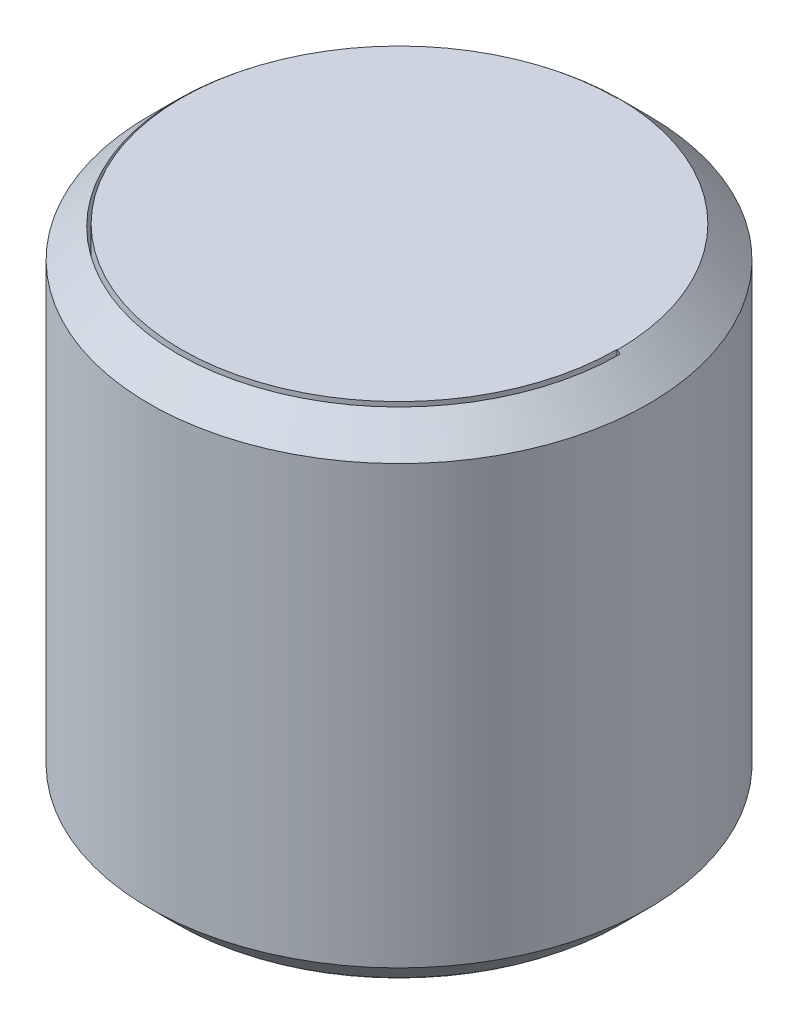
ISO-10303-21;
HEADER;
FILE_DESCRIPTION(('STEP AP214'),'2;1');
FILE_NAME('part.step','',(''),(''),'','','');
FILE_SCHEMA(('AUTOMOTIVE_DESIGN { 1 0 10303 214 1 1 1 1 }'));
ENDSEC;
DATA;
#1=APPLICATION_CONTEXT('core data for automotive mechanical design processes');
#2=APPLICATION_PROTOCOL_DEFINITION('international standard','automotive_design',2000,#1);
#3=PRODUCT_CONTEXT('',#1,'mechanical');
#4=PRODUCT('Part','Part','',(#3));
#5=PRODUCT_RELATED_PRODUCT_CATEGORY('part','',(#4));
#6=PRODUCT_DEFINITION_FORMATION('','',#4);
#7=PRODUCT_DEFINITION_CONTEXT('part definition',#1,'design');
#8=PRODUCT_DEFINITION('design','',#6,#7);
#9=PRODUCT_DEFINITION_SHAPE('','',#8);
#10=(LENGTH_UNIT() NAMED_UNIT(*) SI_UNIT(.MILLI.,.METRE.));
#11=(NAMED_UNIT(*) PLANE_ANGLE_UNIT() SI_UNIT($,.RADIAN.));
#12=(NAMED_UNIT(*) SI_UNIT($,.STERADIAN.) SOLID_ANGLE_UNIT());
#13=UNCERTAINTY_MEASURE_WITH_UNIT(LENGTH_MEASURE(1.E-05),#10,'distance_accuracy_value','');
#14=(GEOMETRIC_REPRESENTATION_CONTEXT(3) GLOBAL_UNCERTAINTY_ASSIGNED_CONTEXT((#13)) GLOBAL_UNIT_ASSIGNED_CONTEXT((#10,
#11,#12)) REPRESENTATION_CONTEXT('',''));
#15=CARTESIAN_POINT('',(0.,0.,0.));
#16=DIRECTION('',(0.,0.,1.));
#17=DIRECTION('',(1.,0.,0.));
#18=AXIS2_PLACEMENT_3D('',#15,#16,#17);
#19=CARTESIAN_POINT('',(-1.66533453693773E-13,7.99999999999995,0.));
#20=DIRECTION('',(0.,0.999999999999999,0.));
#21=DIRECTION('',(0.,0.,1.00000000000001));
#22=AXIS2_PLACEMENT_3D('',#19,#20,#21);
#23=PLANE('',#22);
#24=DIRECTION('',(1.00000000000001,0.,0.));
#25=VECTOR('',#24,1.);
#26=CARTESIAN_POINT('',(1.7574999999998,7.99999999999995,1.66533453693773E-13));
#27=LINE('',#26,#25);
#28=CARTESIAN_POINT('',(3.48999999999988,7.99999999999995,1.94289029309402E-13));
#29=VERTEX_POINT('',#28);
#30=CARTESIAN_POINT('',(3.49999999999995,7.99999999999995,1.94289029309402E-13));
#31=VERTEX_POINT('',#30);
#32=EDGE_CURVE('E140',#29,#31,#27,.T.);
#33=ORIENTED_EDGE('',*,*,#32,.T.);
#34=CARTESIAN_POINT('',(-1.66533453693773E-13,7.99999999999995,0.));
#35=DIRECTION('',(0.,0.999999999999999,0.));
#36=DIRECTION('',(0.,0.,1.00000000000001));
#37=AXIS2_PLACEMENT_3D('',#34,#35,#36);
#38=CIRCLE('',#37,3.49999999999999);
#39=CARTESIAN_POINT('',(-1.66533453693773E-13,7.99999999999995,-3.49999999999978));
#40=VERTEX_POINT('',#39);
#41=EDGE_CURVE('E136',#31,#40,#38,.T.);
#42=ORIENTED_EDGE('',*,*,#41,.T.);
#43=DIRECTION('',(0.,0.,1.00000000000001));
#44=VECTOR('',#43,1.);
#45=CARTESIAN_POINT('',(-1.11022302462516E-13,7.99999999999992,-1.75749999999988));
#46=LINE('',#45,#44);
#47=CARTESIAN_POINT('',(-3.33066907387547E-13,7.99999999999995,-3.48999999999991));
#48=VERTEX_POINT('',#47);
#49=EDGE_CURVE('E131',#40,#48,#46,.T.);
#50=ORIENTED_EDGE('',*,*,#49,.T.);
#51=CARTESIAN_POINT('',(-1.66533453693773E-13,7.99999999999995,0.));
#52=DIRECTION('',(0.,0.999999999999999,0.));
#53=DIRECTION('',(0.,0.,-1.00000000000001));
#54=AXIS2_PLACEMENT_3D('',#51,#52,#53);
#55=CIRCLE('',#54,3.49);
#56=EDGE_CURVE('E134',#48,#29,#55,.T.);
#57=ORIENTED_EDGE('',*,*,#56,.T.);
#58=EDGE_LOOP('',(#33,#42,#50,#57));
#59=FACE_BOUND('',#58,.T.);
#60=ADVANCED_FACE('F38',(#59),#23,.T.);
#61=CARTESIAN_POINT('',(0.,0.,0.));
#62=DIRECTION('',(0.,-0.999999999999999,0.));
#63=DIRECTION('',(0.,0.,-1.00000000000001));
#64=AXIS2_PLACEMENT_3D('',#61,#62,#63);
#65=PLANE('',#64);
#66=DIRECTION('',(0.,0.,-1.00000000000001));
#67=VECTOR('',#66,1.);
#68=CARTESIAN_POINT('',(-2.22044604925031E-13,0.,-1.75749999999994));
#69=LINE('',#68,#67);
#70=CARTESIAN_POINT('',(0.,0.,-3.48999999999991));
#71=VERTEX_POINT('',#70);
#72=CARTESIAN_POINT('',(-1.11022302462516E-13,0.,-3.49999999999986));
#73=VERTEX_POINT('',#72);
#74=EDGE_CURVE('E156',#71,#73,#69,.T.);
#75=ORIENTED_EDGE('',*,*,#74,.T.);
#76=CARTESIAN_POINT('',(0.,0.,0.));
#77=DIRECTION('',(0.,-0.999999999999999,0.));
#78=DIRECTION('',(0.,0.,-1.00000000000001));
#79=AXIS2_PLACEMENT_3D('',#76,#77,#78);
#80=CIRCLE('',#79,3.49999999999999);
#81=CARTESIAN_POINT('',(3.49999999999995,0.,0.));
#82=VERTEX_POINT('',#81);
#83=EDGE_CURVE('E11',#73,#82,#80,.T.);
#84=ORIENTED_EDGE('',*,*,#83,.T.);
#85=DIRECTION('',(-1.00000000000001,0.,0.));
#86=VECTOR('',#85,1.);
#87=CARTESIAN_POINT('',(1.75749999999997,0.,2.4980018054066E-13));
#88=LINE('',#87,#86);
#89=CARTESIAN_POINT('',(3.48999999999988,0.,1.94289029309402E-13));
#90=VERTEX_POINT('',#89);
#91=EDGE_CURVE('E184',#82,#90,#88,.T.);
#92=ORIENTED_EDGE('',*,*,#91,.T.);
#93=CARTESIAN_POINT('',(0.,0.,0.));
#94=DIRECTION('',(0.,-0.999999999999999,0.));
#95=DIRECTION('',(0.,0.,-1.00000000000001));
#96=AXIS2_PLACEMENT_3D('',#93,#94,#95);
#97=CIRCLE('',#96,3.49);
#98=EDGE_CURVE('E141',#90,#71,#97,.T.);
#99=ORIENTED_EDGE('',*,*,#98,.T.);
#100=EDGE_LOOP('',(#75,#84,#92,#99));
#101=FACE_BOUND('',#100,.T.);
#102=DIRECTION('',(0.500000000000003,0.,0.866025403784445));
#103=VECTOR('',#102,1.);
#104=CARTESIAN_POINT('',(-1.44337567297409,0.,1.50000000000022));
#105=LINE('',#104,#103);
#106=CARTESIAN_POINT('',(-2.30940107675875,0.,0.));
#107=VERTEX_POINT('',#106);
#108=CARTESIAN_POINT('',(-1.15470053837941,0.,2.00000000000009));
#109=VERTEX_POINT('',#108);
#110=EDGE_CURVE('E169',#107,#109,#105,.T.);
#111=ORIENTED_EDGE('',*,*,#110,.T.);
#112=DIRECTION('',(1.00000000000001,0.,0.));
#113=VECTOR('',#112,1.);
#114=CARTESIAN_POINT('',(0.577350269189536,0.,2.00000000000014));
#115=LINE('',#114,#113);
#116=CARTESIAN_POINT('',(1.15470053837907,0.,2.0000000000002));
#117=VERTEX_POINT('',#116);
#118=EDGE_CURVE('E203',#109,#117,#115,.T.);
#119=ORIENTED_EDGE('',*,*,#118,.T.);
#120=DIRECTION('',(0.500000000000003,0.,-0.866025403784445));
#121=VECTOR('',#120,1.);
#122=CARTESIAN_POINT('',(2.02072594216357,0.,0.500000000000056));
#123=LINE('',#122,#121);
#124=CARTESIAN_POINT('',(2.30940107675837,0.,0.));
#125=VERTEX_POINT('',#124);
#126=EDGE_CURVE('E175',#117,#125,#123,.T.);
#127=ORIENTED_EDGE('',*,*,#126,.T.);
#128=DIRECTION('',(-0.500000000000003,0.,-0.866025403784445));
#129=VECTOR('',#128,1.);
#130=CARTESIAN_POINT('',(1.44337567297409,0.,-1.49999999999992));
#131=LINE('',#130,#129);
#132=CARTESIAN_POINT('',(1.15470053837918,0.,-1.99999999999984));
#133=VERTEX_POINT('',#132);
#134=EDGE_CURVE('E171',#125,#133,#131,.T.);
#135=ORIENTED_EDGE('',*,*,#134,.T.);
#136=DIRECTION('',(-1.00000000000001,0.,0.));
#137=VECTOR('',#136,1.);
#138=CARTESIAN_POINT('',(-0.577350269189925,0.,-1.99999999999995));
#139=LINE('',#138,#137);
#140=CARTESIAN_POINT('',(-1.15470053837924,0.,-1.99999999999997));
#141=VERTEX_POINT('',#140);
#142=EDGE_CURVE('E176',#133,#141,#139,.T.);
#143=ORIENTED_EDGE('',*,*,#142,.T.);
#144=DIRECTION('',(-0.500000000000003,0.,0.866025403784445));
#145=VECTOR('',#144,1.);
#146=CARTESIAN_POINT('',(-2.0207259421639,0.,-0.499999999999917));
#147=LINE('',#146,#145);
#148=EDGE_CURVE('E197',#141,#107,#147,.T.);
#149=ORIENTED_EDGE('',*,*,#148,.T.);
#150=EDGE_LOOP('',(#111,#119,#127,#135,#143,#149));
#151=FACE_BOUND('',#150,.T.);
#152=ADVANCED_FACE('F262',(#101,#151),#65,.T.);
#153=CARTESIAN_POINT('',(0.,4.,0.));
#154=DIRECTION('',(0.,-0.999999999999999,0.));
#155=DIRECTION('',(0.,0.,-1.00000000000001));
#156=AXIS2_PLACEMENT_3D('',#153,#154,#155);
#157=CYLINDRICAL_SURFACE('',#156,4.);
#158=CARTESIAN_POINT('',(-1.66533453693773E-13,7.49999999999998,0.));
#159=DIRECTION('',(0.,0.999999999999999,0.));
#160=DIRECTION('',(0.,0.,1.00000000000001));
#161=AXIS2_PLACEMENT_3D('',#158,#159,#160);
#162=CIRCLE('',#161,4.);
#163=CARTESIAN_POINT('',(0.,7.49999999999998,-4.00000000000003));
#164=VERTEX_POINT('',#163);
#165=EDGE_CURVE('E47',#164,#164,#162,.F.);
#166=CARTESIAN_POINT('',(0.,0.5,0.));
#167=DIRECTION('',(0.,-0.999999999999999,0.));
#168=DIRECTION('',(0.,0.,-1.00000000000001));
#169=AXIS2_PLACEMENT_3D('',#166,#167,#168);
#170=CIRCLE('',#169,4.);
#171=CARTESIAN_POINT('',(0.,0.500000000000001,-4.00000000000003));
#172=VERTEX_POINT('',#171);
#173=EDGE_CURVE('E243',#172,#172,#170,.F.);
#174=CARTESIAN_POINT('',(0.,7.49999999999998,-4.00000000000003));
#175=CARTESIAN_POINT('',(0.,7.42708333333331,-4.00000000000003));
#176=CARTESIAN_POINT('',(0.,7.35416666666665,-4.00000000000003));
#177=CARTESIAN_POINT('',(0.,7.20833333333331,-4.00000000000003));
#178=CARTESIAN_POINT('',(0.,7.13541666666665,-4.00000000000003));
#179=CARTESIAN_POINT('',(0.,6.98958333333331,-4.00000000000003));
#180=CARTESIAN_POINT('',(0.,6.91666666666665,-4.00000000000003));
#181=CARTESIAN_POINT('',(0.,6.77083333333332,-4.00000000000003));
#182=CARTESIAN_POINT('',(0.,6.69791666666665,-4.00000000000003));
#183=CARTESIAN_POINT('',(0.,6.55208333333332,-4.00000000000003));
#184=CARTESIAN_POINT('',(0.,6.47916666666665,-4.00000000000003));
#185=CARTESIAN_POINT('',(0.,6.33333333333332,-4.00000000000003));
#186=CARTESIAN_POINT('',(0.,6.26041666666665,-4.00000000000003));
#187=CARTESIAN_POINT('',(0.,6.11458333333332,-4.00000000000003));
#188=CARTESIAN_POINT('',(0.,6.04166666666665,-4.00000000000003));
#189=CARTESIAN_POINT('',(0.,5.89583333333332,-4.00000000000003));
#190=CARTESIAN_POINT('',(0.,5.82291666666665,-4.00000000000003));
#191=CARTESIAN_POINT('',(0.,5.67708333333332,-4.00000000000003));
#192=CARTESIAN_POINT('',(0.,5.60416666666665,-4.00000000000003));
#193=CARTESIAN_POINT('',(0.,5.45833333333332,-4.00000000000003));
#194=CARTESIAN_POINT('',(0.,5.38541666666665,-4.00000000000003));
#195=CARTESIAN_POINT('',(0.,5.23958333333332,-4.00000000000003));
#196=CARTESIAN_POINT('',(0.,5.16666666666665,-4.00000000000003));
#197=CARTESIAN_POINT('',(0.,5.02083333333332,-4.00000000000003));
#198=CARTESIAN_POINT('',(0.,4.94791666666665,-4.00000000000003));
#199=CARTESIAN_POINT('',(0.,4.80208333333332,-4.00000000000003));
#200=CARTESIAN_POINT('',(0.,4.72916666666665,-4.00000000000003));
#201=CARTESIAN_POINT('',(0.,4.58333333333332,-4.00000000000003));
#202=CARTESIAN_POINT('',(0.,4.51041666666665,-4.00000000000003));
#203=CARTESIAN_POINT('',(0.,4.36458333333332,-4.00000000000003));
#204=CARTESIAN_POINT('',(0.,4.29166666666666,-4.00000000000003));
#205=CARTESIAN_POINT('',(0.,4.14583333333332,-4.00000000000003));
#206=CARTESIAN_POINT('',(0.,4.07291666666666,-4.00000000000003));
#207=CARTESIAN_POINT('',(0.,3.92708333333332,-4.00000000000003));
#208=CARTESIAN_POINT('',(0.,3.85416666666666,-4.00000000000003));
#209=CARTESIAN_POINT('',(0.,3.70833333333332,-4.00000000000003));
#210=CARTESIAN_POINT('',(0.,3.63541666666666,-4.00000000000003));
#211=CARTESIAN_POINT('',(0.,3.48958333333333,-4.00000000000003));
#212=CARTESIAN_POINT('',(0.,3.41666666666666,-4.00000000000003));
#213=CARTESIAN_POINT('',(0.,3.27083333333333,-4.00000000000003));
#214=CARTESIAN_POINT('',(0.,3.19791666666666,-4.00000000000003));
#215=CARTESIAN_POINT('',(0.,3.05208333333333,-4.00000000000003));
#216=CARTESIAN_POINT('',(0.,2.97916666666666,-4.00000000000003));
#217=CARTESIAN_POINT('',(0.,2.83333333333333,-4.00000000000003));
#218=CARTESIAN_POINT('',(0.,2.76041666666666,-4.00000000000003));
#219=CARTESIAN_POINT('',(0.,2.61458333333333,-4.00000000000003));
#220=CARTESIAN_POINT('',(0.,2.54166666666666,-4.00000000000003));
#221=CARTESIAN_POINT('',(0.,2.39583333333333,-4.00000000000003));
#222=CARTESIAN_POINT('',(0.,2.32291666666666,-4.00000000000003));
#223=CARTESIAN_POINT('',(0.,2.17708333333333,-4.00000000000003));
#224=CARTESIAN_POINT('',(0.,2.10416666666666,-4.00000000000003));
#225=CARTESIAN_POINT('',(0.,1.95833333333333,-4.00000000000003));
#226=CARTESIAN_POINT('',(0.,1.88541666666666,-4.00000000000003));
#227=CARTESIAN_POINT('',(0.,1.73958333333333,-4.00000000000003));
#228=CARTESIAN_POINT('',(0.,1.66666666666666,-4.00000000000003));
#229=CARTESIAN_POINT('',(0.,1.52083333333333,-4.00000000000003));
#230=CARTESIAN_POINT('',(0.,1.44791666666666,-4.00000000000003));
#231=CARTESIAN_POINT('',(0.,1.30208333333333,-4.00000000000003));
#232=CARTESIAN_POINT('',(0.,1.22916666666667,-4.00000000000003));
#233=CARTESIAN_POINT('',(0.,1.08333333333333,-4.00000000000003));
#234=CARTESIAN_POINT('',(0.,1.01041666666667,-4.00000000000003));
#235=CARTESIAN_POINT('',(0.,0.864583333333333,-4.00000000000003));
#236=CARTESIAN_POINT('',(0.,0.791666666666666,-4.00000000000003));
#237=CARTESIAN_POINT('',(0.,0.645833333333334,-4.00000000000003));
#238=CARTESIAN_POINT('',(0.,0.572916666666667,-4.00000000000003));
#239=CARTESIAN_POINT('',(0.,0.500000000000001,-4.00000000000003));
#240=B_SPLINE_CURVE_WITH_KNOTS('',3,(#174,#175,#176,#177,#178,#179,#180,#181,#182,#183,#184,
#185,#186,#187,#188,#189,#190,#191,#192,#193,#194,#195,#196,#197,#198,#199,#200,#201,#202,#203,
#204,#205,#206,#207,#208,#209,#210,#211,#212,#213,#214,#215,#216,#217,#218,#219,#220,#221,#222,
#223,#224,#225,#226,#227,#228,#229,#230,#231,#232,#233,#234,#235,#236,#237,#238,#239),
.UNSPECIFIED.,.F.,.F.,(4,2,2,2,2,2,2,2,2,2,2,2,2,2,2,2,2,2,2,2,2,2,2,2,2,2,2,2,2,2,2,2,4),(0.,
0.218749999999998,0.437499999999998,0.656249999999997,0.874999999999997,1.09375,1.3125,
1.53124999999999,1.74999999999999,1.96874999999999,2.18749999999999,2.40624999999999,
2.62499999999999,2.84374999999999,3.06249999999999,3.28124999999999,3.49999999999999,
3.71874999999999,3.93749999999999,4.15624999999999,4.37499999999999,4.59374999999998,
4.81249999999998,5.03124999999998,5.24999999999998,5.46874999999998,5.68749999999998,
5.90624999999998,6.12499999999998,6.34374999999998,6.56249999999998,6.78124999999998,
6.99999999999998),.UNSPECIFIED.);
#241=EDGE_CURVE('BSEAM250',#164,#172,#240,.T.);
#242=ORIENTED_EDGE('',*,*,#165,.T.);
#243=ORIENTED_EDGE('',*,*,#173,.T.);
#244=ORIENTED_EDGE('',*,*,#241,.T.);
#245=ORIENTED_EDGE('',*,*,#241,.F.);
#246=EDGE_LOOP('',(#242,#244,#243,#245));
#247=FACE_BOUND('',#246,.T.);
#248=ADVANCED_FACE('F250',(#247),#157,.T.);
#249=CARTESIAN_POINT('',(3.51499999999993,4.00000000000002,1.11022302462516E-13));
#250=DIRECTION('',(0.,0.,1.00000000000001));
#251=DIRECTION('',(1.00000000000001,0.,0.));
#252=AXIS2_PLACEMENT_3D('',#249,#250,#251);
#253=PLANE('',#252);
#254=DIRECTION('',(0.,0.999999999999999,0.));
#255=VECTOR('',#254,1.);
#256=CARTESIAN_POINT('',(3.53999999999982,7.99999999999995,1.11022302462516E-13));
#257=LINE('',#256,#255);
#258=CARTESIAN_POINT('',(3.53999999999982,0.0400000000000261,1.11022302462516E-13));
#259=VERTEX_POINT('',#258);
#260=CARTESIAN_POINT('',(3.53999999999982,7.95999999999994,1.11022302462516E-13));
#261=VERTEX_POINT('',#260);
#262=EDGE_CURVE('E162',#259,#261,#257,.T.);
#263=ORIENTED_EDGE('',*,*,#262,.T.);
#264=DIRECTION('',(-0.707106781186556,0.707106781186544,0.));
#265=VECTOR('',#264,1.);
#266=CARTESIAN_POINT('',(-1.66533453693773E-13,11.4999999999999,0.));
#267=LINE('',#266,#265);
#268=EDGE_CURVE('E240',#261,#31,#267,.T.);
#269=ORIENTED_EDGE('',*,*,#268,.T.);
#270=ORIENTED_EDGE('',*,*,#32,.F.);
#271=DIRECTION('',(0.,-0.999999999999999,0.));
#272=VECTOR('',#271,1.);
#273=CARTESIAN_POINT('',(3.48999999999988,0.,1.94289029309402E-13));
#274=LINE('',#273,#272);
#275=EDGE_CURVE('E149',#29,#90,#274,.T.);
#276=ORIENTED_EDGE('',*,*,#275,.T.);
#277=ORIENTED_EDGE('',*,*,#91,.F.);
#278=DIRECTION('',(0.707106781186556,0.707106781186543,0.));
#279=VECTOR('',#278,1.);
#280=CARTESIAN_POINT('',(-2.22044604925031E-13,-3.49999999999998,0.));
#281=LINE('',#280,#279);
#282=EDGE_CURVE('E54',#82,#259,#281,.T.);
#283=ORIENTED_EDGE('',*,*,#282,.T.);
#284=EDGE_LOOP('',(#263,#269,#270,#276,#277,#283));
#285=FACE_BOUND('',#284,.T.);
#286=ADVANCED_FACE('F327',(#285),#253,.T.);
#287=CARTESIAN_POINT('',(0.,3.99999999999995,-3.51499999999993));
#288=DIRECTION('',(-1.00000000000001,0.,0.));
#289=DIRECTION('',(0.,0.,1.00000000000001));
#290=AXIS2_PLACEMENT_3D('',#287,#288,#289);
#291=PLANE('',#290);
#292=ORIENTED_EDGE('',*,*,#49,.F.);
#293=DIRECTION('',(0.,-0.707106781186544,-0.707106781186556));
#294=VECTOR('',#293,1.);
#295=CARTESIAN_POINT('',(-1.66533453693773E-13,11.4999999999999,0.));
#296=LINE('',#295,#294);
#297=CARTESIAN_POINT('',(0.,7.95999999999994,-3.5399999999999));
#298=VERTEX_POINT('',#297);
#299=EDGE_CURVE('E230',#40,#298,#296,.T.);
#300=ORIENTED_EDGE('',*,*,#299,.T.);
#301=DIRECTION('',(0.,-0.999999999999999,0.));
#302=VECTOR('',#301,1.);
#303=CARTESIAN_POINT('',(0.,7.99999999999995,-3.5399999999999));
#304=LINE('',#303,#302);
#305=CARTESIAN_POINT('',(-1.66533453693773E-13,0.0399999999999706,-3.53999999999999));
#306=VERTEX_POINT('',#305);
#307=EDGE_CURVE('E158',#298,#306,#304,.T.);
#308=ORIENTED_EDGE('',*,*,#307,.T.);
#309=DIRECTION('',(0.,-0.707106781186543,0.707106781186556));
#310=VECTOR('',#309,1.);
#311=CARTESIAN_POINT('',(-2.22044604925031E-13,-3.49999999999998,0.));
#312=LINE('',#311,#310);
#313=EDGE_CURVE('E227',#306,#73,#312,.T.);
#314=ORIENTED_EDGE('',*,*,#313,.T.);
#315=ORIENTED_EDGE('',*,*,#74,.F.);
#316=DIRECTION('',(0.,0.999999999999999,0.));
#317=VECTOR('',#316,1.);
#318=CARTESIAN_POINT('',(0.,0.,-3.48999999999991));
#319=LINE('',#318,#317);
#320=EDGE_CURVE('E146',#71,#48,#319,.T.);
#321=ORIENTED_EDGE('',*,*,#320,.T.);
#322=EDGE_LOOP('',(#292,#300,#308,#314,#315,#321));
#323=FACE_BOUND('',#322,.T.);
#324=ADVANCED_FACE('F154',(#323),#291,.T.);
#325=CARTESIAN_POINT('',(0.,4.,0.));
#326=DIRECTION('',(0.,-0.999999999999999,0.));
#327=DIRECTION('',(0.,0.,-1.00000000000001));
#328=AXIS2_PLACEMENT_3D('',#325,#326,#327);
#329=CYLINDRICAL_SURFACE('',#328,3.49);
#330=ORIENTED_EDGE('',*,*,#98,.F.);
#331=ORIENTED_EDGE('',*,*,#275,.F.);
#332=ORIENTED_EDGE('',*,*,#56,.F.);
#333=ORIENTED_EDGE('',*,*,#320,.F.);
#334=EDGE_LOOP('',(#330,#331,#332,#333));
#335=FACE_BOUND('',#334,.T.);
#336=ADVANCED_FACE('F145',(#335),#329,.T.);
#337=CARTESIAN_POINT('',(0.,4.,0.));
#338=DIRECTION('',(0.,-0.999999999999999,0.));
#339=DIRECTION('',(0.,0.,-1.00000000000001));
#340=AXIS2_PLACEMENT_3D('',#337,#338,#339);
#341=CYLINDRICAL_SURFACE('',#340,3.54);
#342=ORIENTED_EDGE('',*,*,#307,.F.);
#343=CARTESIAN_POINT('',(-1.66533453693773E-13,7.95999999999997,0.));
#344=DIRECTION('',(0.,-0.999999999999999,0.));
#345=DIRECTION('',(0.,0.,-1.00000000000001));
#346=AXIS2_PLACEMENT_3D('',#343,#344,#345);
#347=CIRCLE('',#346,3.54);
#348=EDGE_CURVE('E61',#298,#261,#347,.F.);
#349=ORIENTED_EDGE('',*,*,#348,.T.);
#350=ORIENTED_EDGE('',*,*,#262,.F.);
#351=CARTESIAN_POINT('',(0.,0.0400000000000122,0.));
#352=DIRECTION('',(0.,0.999999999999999,0.));
#353=DIRECTION('',(0.,0.,1.00000000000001));
#354=AXIS2_PLACEMENT_3D('',#351,#352,#353);
#355=CIRCLE('',#354,3.54);
#356=EDGE_CURVE('E233',#259,#306,#355,.F.);
#357=ORIENTED_EDGE('',*,*,#356,.T.);
#358=EDGE_LOOP('',(#342,#349,#350,#357));
#359=FACE_BOUND('',#358,.T.);
#360=ADVANCED_FACE('F40',(#359),#341,.F.);
#361=CARTESIAN_POINT('',(0.,5.,0.));
#362=DIRECTION('',(0.,-0.999999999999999,0.));
#363=DIRECTION('',(0.,0.,-1.00000000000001));
#364=AXIS2_PLACEMENT_3D('',#361,#362,#363);
#365=PLANE('',#364);
#366=DIRECTION('',(-0.500000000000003,0.,-0.866025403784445));
#367=VECTOR('',#366,1.);
#368=CARTESIAN_POINT('',(-1.15470053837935,5.,2.00000000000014));
#369=LINE('',#368,#367);
#370=CARTESIAN_POINT('',(-1.15470053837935,5.,2.00000000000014));
#371=VERTEX_POINT('',#370);
#372=CARTESIAN_POINT('',(-2.30940107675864,5.,0.));
#373=VERTEX_POINT('',#372);
#374=EDGE_CURVE('E165',#371,#373,#369,.T.);
#375=ORIENTED_EDGE('',*,*,#374,.T.);
#376=DIRECTION('',(0.500000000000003,0.,-0.866025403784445));
#377=VECTOR('',#376,1.);
#378=CARTESIAN_POINT('',(-2.30940107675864,5.,0.));
#379=LINE('',#378,#377);
#380=CARTESIAN_POINT('',(-1.15470053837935,5.,-1.99999999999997));
#381=VERTEX_POINT('',#380);
#382=EDGE_CURVE('E177',#373,#381,#379,.T.);
#383=ORIENTED_EDGE('',*,*,#382,.T.);
#384=DIRECTION('',(1.00000000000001,0.,0.));
#385=VECTOR('',#384,1.);
#386=CARTESIAN_POINT('',(-1.15470053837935,5.,-1.99999999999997));
#387=LINE('',#386,#385);
#388=CARTESIAN_POINT('',(1.15470053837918,4.99999999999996,-1.99999999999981));
#389=VERTEX_POINT('',#388);
#390=EDGE_CURVE('E181',#381,#389,#387,.T.);
#391=ORIENTED_EDGE('',*,*,#390,.T.);
#392=DIRECTION('',(0.500000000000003,0.,0.866025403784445));
#393=VECTOR('',#392,1.);
#394=CARTESIAN_POINT('',(1.15470053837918,4.99999999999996,-1.99999999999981));
#395=LINE('',#394,#393);
#396=CARTESIAN_POINT('',(2.30940107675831,5.00000000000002,1.38777878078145E-13));
#397=VERTEX_POINT('',#396);
#398=EDGE_CURVE('E189',#389,#397,#395,.T.);
#399=ORIENTED_EDGE('',*,*,#398,.T.);
#400=DIRECTION('',(-0.500000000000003,0.,0.866025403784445));
#401=VECTOR('',#400,1.);
#402=CARTESIAN_POINT('',(2.30940107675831,5.00000000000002,1.38777878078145E-13));
#403=LINE('',#402,#401);
#404=CARTESIAN_POINT('',(1.15470053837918,5.,2.00000000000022));
#405=VERTEX_POINT('',#404);
#406=EDGE_CURVE('E185',#397,#405,#403,.T.);
#407=ORIENTED_EDGE('',*,*,#406,.T.);
#408=DIRECTION('',(-1.00000000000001,0.,0.));
#409=VECTOR('',#408,1.);
#410=CARTESIAN_POINT('',(1.15470053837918,5.,2.00000000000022));
#411=LINE('',#410,#409);
#412=EDGE_CURVE('E190',#405,#371,#411,.T.);
#413=ORIENTED_EDGE('',*,*,#412,.T.);
#414=EDGE_LOOP('',(#375,#383,#391,#399,#407,#413));
#415=FACE_BOUND('',#414,.T.);
#416=ADVANCED_FACE('F287',(#415),#365,.T.);
#417=CARTESIAN_POINT('',(1.15470053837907,0.,2.0000000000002));
#418=DIRECTION('',(0.,0.,-1.00000000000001));
#419=DIRECTION('',(-1.00000000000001,0.,0.));
#420=AXIS2_PLACEMENT_3D('',#417,#418,#419);
#421=PLANE('',#420);
#422=ORIENTED_EDGE('',*,*,#412,.F.);
#423=DIRECTION('',(0.,0.999999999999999,0.));
#424=VECTOR('',#423,1.);
#425=CARTESIAN_POINT('',(1.15470053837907,0.,2.0000000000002));
#426=LINE('',#425,#424);
#427=EDGE_CURVE('E195',#117,#405,#426,.T.);
#428=ORIENTED_EDGE('',*,*,#427,.F.);
#429=ORIENTED_EDGE('',*,*,#118,.F.);
#430=DIRECTION('',(0.,0.999999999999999,0.));
#431=VECTOR('',#430,1.);
#432=CARTESIAN_POINT('',(-1.15470053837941,0.,2.00000000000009));
#433=LINE('',#432,#431);
#434=EDGE_CURVE('E206',#109,#371,#433,.T.);
#435=ORIENTED_EDGE('',*,*,#434,.T.);
#436=EDGE_LOOP('',(#422,#428,#429,#435));
#437=FACE_BOUND('',#436,.T.);
#438=ADVANCED_FACE('F291',(#437),#421,.T.);
#439=CARTESIAN_POINT('',(2.30940107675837,0.,0.));
#440=DIRECTION('',(-0.866025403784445,0.,-0.500000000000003));
#441=DIRECTION('',(-0.500000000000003,0.,0.866025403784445));
#442=AXIS2_PLACEMENT_3D('',#439,#440,#441);
#443=PLANE('',#442);
#444=ORIENTED_EDGE('',*,*,#406,.F.);
#445=DIRECTION('',(0.,0.999999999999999,0.));
#446=VECTOR('',#445,1.);
#447=CARTESIAN_POINT('',(2.30940107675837,0.,0.));
#448=LINE('',#447,#446);
#449=EDGE_CURVE('E191',#125,#397,#448,.T.);
#450=ORIENTED_EDGE('',*,*,#449,.F.);
#451=ORIENTED_EDGE('',*,*,#126,.F.);
#452=ORIENTED_EDGE('',*,*,#427,.T.);
#453=EDGE_LOOP('',(#444,#450,#451,#452));
#454=FACE_BOUND('',#453,.T.);
#455=ADVANCED_FACE('F304',(#454),#443,.T.);
#456=CARTESIAN_POINT('',(1.15470053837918,0.,-1.99999999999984));
#457=DIRECTION('',(-0.866025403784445,0.,0.500000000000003));
#458=DIRECTION('',(0.500000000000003,0.,0.866025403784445));
#459=AXIS2_PLACEMENT_3D('',#456,#457,#458);
#460=PLANE('',#459);
#461=ORIENTED_EDGE('',*,*,#398,.F.);
#462=DIRECTION('',(0.,0.999999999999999,0.));
#463=VECTOR('',#462,1.);
#464=CARTESIAN_POINT('',(1.15470053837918,0.,-1.99999999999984));
#465=LINE('',#464,#463);
#466=EDGE_CURVE('E196',#133,#389,#465,.T.);
#467=ORIENTED_EDGE('',*,*,#466,.F.);
#468=ORIENTED_EDGE('',*,*,#134,.F.);
#469=ORIENTED_EDGE('',*,*,#449,.T.);
#470=EDGE_LOOP('',(#461,#467,#468,#469));
#471=FACE_BOUND('',#470,.T.);
#472=ADVANCED_FACE('F302',(#471),#460,.T.);
#473=CARTESIAN_POINT('',(-1.15470053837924,0.,-1.99999999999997));
#474=DIRECTION('',(0.,0.,1.00000000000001));
#475=DIRECTION('',(1.00000000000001,0.,0.));
#476=AXIS2_PLACEMENT_3D('',#473,#474,#475);
#477=PLANE('',#476);
#478=ORIENTED_EDGE('',*,*,#390,.F.);
#479=DIRECTION('',(0.,0.999999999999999,0.));
#480=VECTOR('',#479,1.);
#481=CARTESIAN_POINT('',(-1.15470053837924,0.,-1.99999999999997));
#482=LINE('',#481,#480);
#483=EDGE_CURVE('E211',#141,#381,#482,.T.);
#484=ORIENTED_EDGE('',*,*,#483,.F.);
#485=ORIENTED_EDGE('',*,*,#142,.F.);
#486=ORIENTED_EDGE('',*,*,#466,.T.);
#487=EDGE_LOOP('',(#478,#484,#485,#486));
#488=FACE_BOUND('',#487,.T.);
#489=ADVANCED_FACE('F308',(#488),#477,.T.);
#490=CARTESIAN_POINT('',(-2.30940107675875,0.,0.));
#491=DIRECTION('',(0.866025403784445,0.,0.500000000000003));
#492=DIRECTION('',(0.500000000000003,0.,-0.866025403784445));
#493=AXIS2_PLACEMENT_3D('',#490,#491,#492);
#494=PLANE('',#493);
#495=ORIENTED_EDGE('',*,*,#382,.F.);
#496=DIRECTION('',(0.,0.999999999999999,0.));
#497=VECTOR('',#496,1.);
#498=CARTESIAN_POINT('',(-2.30940107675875,0.,0.));
#499=LINE('',#498,#497);
#500=EDGE_CURVE('E215',#107,#373,#499,.T.);
#501=ORIENTED_EDGE('',*,*,#500,.F.);
#502=ORIENTED_EDGE('',*,*,#148,.F.);
#503=ORIENTED_EDGE('',*,*,#483,.T.);
#504=EDGE_LOOP('',(#495,#501,#502,#503));
#505=FACE_BOUND('',#504,.T.);
#506=ADVANCED_FACE('F284',(#505),#494,.T.);
#507=CARTESIAN_POINT('',(-1.15470053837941,0.,2.00000000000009));
#508=DIRECTION('',(0.866025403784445,0.,-0.500000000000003));
#509=DIRECTION('',(-0.500000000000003,0.,-0.866025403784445));
#510=AXIS2_PLACEMENT_3D('',#507,#508,#509);
#511=PLANE('',#510);
#512=ORIENTED_EDGE('',*,*,#374,.F.);
#513=ORIENTED_EDGE('',*,*,#434,.F.);
#514=ORIENTED_EDGE('',*,*,#110,.F.);
#515=ORIENTED_EDGE('',*,*,#500,.T.);
#516=EDGE_LOOP('',(#512,#513,#514,#515));
#517=FACE_BOUND('',#516,.T.);
#518=ADVANCED_FACE('F257',(#517),#511,.T.);
#519=CARTESIAN_POINT('',(-1.66533453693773E-13,7.99999999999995,0.));
#520=DIRECTION('',(0.,-0.999999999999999,0.));
#521=DIRECTION('',(0.,0.,-1.00000000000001));
#522=AXIS2_PLACEMENT_3D('',#519,#520,#521);
#523=CONICAL_SURFACE('',#522,3.49999999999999,0.785398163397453);
#524=ORIENTED_EDGE('',*,*,#165,.F.);
#525=EDGE_LOOP('',(#524));
#526=FACE_BOUND('',#525,.T.);
#527=ORIENTED_EDGE('',*,*,#299,.F.);
#528=ORIENTED_EDGE('',*,*,#41,.F.);
#529=ORIENTED_EDGE('',*,*,#268,.F.);
#530=ORIENTED_EDGE('',*,*,#348,.F.);
#531=EDGE_LOOP('',(#527,#528,#529,#530));
#532=FACE_BOUND('',#531,.T.);
#533=ADVANCED_FACE('F253',(#526,#532),#523,.T.);
#534=CARTESIAN_POINT('',(0.,0.,0.));
#535=DIRECTION('',(0.,0.999999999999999,0.));
#536=DIRECTION('',(0.,0.,1.00000000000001));
#537=AXIS2_PLACEMENT_3D('',#534,#535,#536);
#538=CONICAL_SURFACE('',#537,3.49999999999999,0.785398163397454);
#539=ORIENTED_EDGE('',*,*,#173,.F.);
#540=EDGE_LOOP('',(#539));
#541=FACE_BOUND('',#540,.T.);
#542=ORIENTED_EDGE('',*,*,#282,.F.);
#543=ORIENTED_EDGE('',*,*,#83,.F.);
#544=ORIENTED_EDGE('',*,*,#313,.F.);
#545=ORIENTED_EDGE('',*,*,#356,.F.);
#546=EDGE_LOOP('',(#542,#543,#544,#545));
#547=FACE_BOUND('',#546,.T.);
#548=ADVANCED_FACE('F256',(#541,#547),#538,.T.);
#549=CLOSED_SHELL('',(#60,#152,#248,#286,#324,#336,#360,#416,#438,#455,#472,#489,#506,#518,#533,#548));
#550=MANIFOLD_SOLID_BREP('B2',#549);
#551=ADVANCED_BREP_SHAPE_REPRESENTATION('',(#18,#550),#14);
#552=SHAPE_DEFINITION_REPRESENTATION(#9,#551);
ENDSEC;
END-ISO-10303-21;
